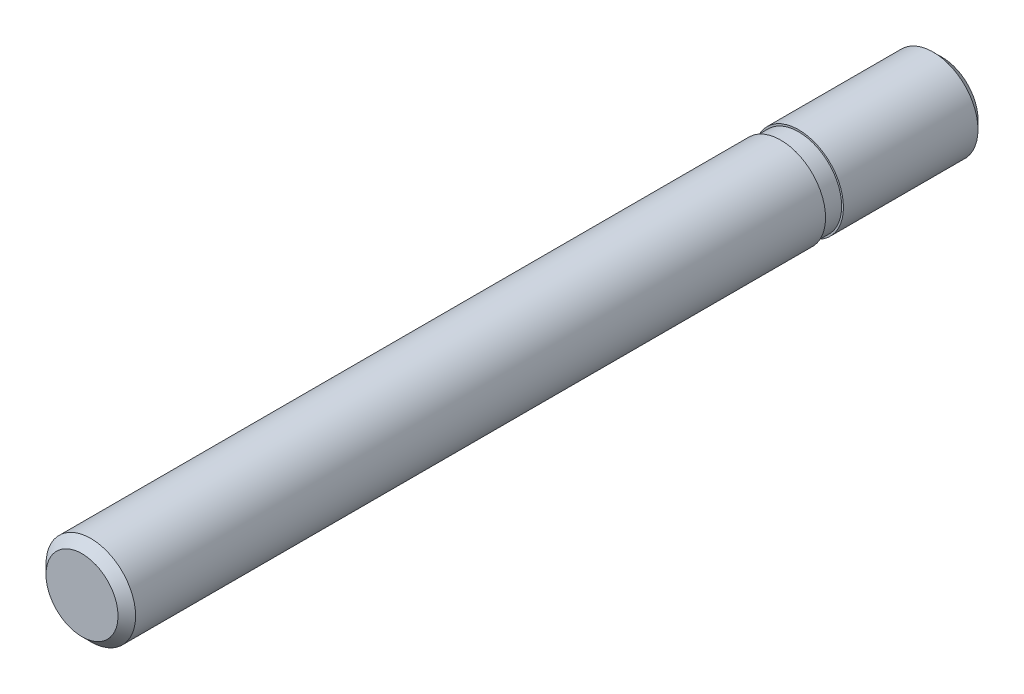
ISO-10303-21;
HEADER;
FILE_DESCRIPTION(('STEP AP214'),'2;1');
FILE_NAME('part.step','',(''),(''),'','','');
FILE_SCHEMA(('AUTOMOTIVE_DESIGN { 1 0 10303 214 1 1 1 1 }'));
ENDSEC;
DATA;
#1=APPLICATION_CONTEXT('core data for automotive mechanical design processes');
#2=APPLICATION_PROTOCOL_DEFINITION('international standard','automotive_design',2000,#1);
#3=PRODUCT_CONTEXT('',#1,'mechanical');
#4=PRODUCT('Part','Part','',(#3));
#5=PRODUCT_RELATED_PRODUCT_CATEGORY('part','',(#4));
#6=PRODUCT_DEFINITION_FORMATION('','',#4);
#7=PRODUCT_DEFINITION_CONTEXT('part definition',#1,'design');
#8=PRODUCT_DEFINITION('design','',#6,#7);
#9=PRODUCT_DEFINITION_SHAPE('','',#8);
#10=(LENGTH_UNIT() NAMED_UNIT(*) SI_UNIT(.MILLI.,.METRE.));
#11=(NAMED_UNIT(*) PLANE_ANGLE_UNIT() SI_UNIT($,.RADIAN.));
#12=(NAMED_UNIT(*) SI_UNIT($,.STERADIAN.) SOLID_ANGLE_UNIT());
#13=UNCERTAINTY_MEASURE_WITH_UNIT(LENGTH_MEASURE(1.E-05),#10,'distance_accuracy_value','');
#14=(GEOMETRIC_REPRESENTATION_CONTEXT(3) GLOBAL_UNCERTAINTY_ASSIGNED_CONTEXT((#13)) GLOBAL_UNIT_ASSIGNED_CONTEXT((#10,
#11,#12)) REPRESENTATION_CONTEXT('',''));
#15=CARTESIAN_POINT('',(0.,0.,0.));
#16=DIRECTION('',(0.,0.,1.));
#17=DIRECTION('',(1.,0.,0.));
#18=AXIS2_PLACEMENT_3D('',#15,#16,#17);
#19=CARTESIAN_POINT('',(0.,0.,0.));
#20=DIRECTION('',(0.,0.,1.));
#21=DIRECTION('',(1.,0.,0.));
#22=AXIS2_PLACEMENT_3D('',#19,#20,#21);
#23=PLANE('',#22);
#24=CARTESIAN_POINT('',(0.,0.,0.));
#25=DIRECTION('',(0.,0.,1.));
#26=DIRECTION('',(1.,0.,0.));
#27=AXIS2_PLACEMENT_3D('',#24,#25,#26);
#28=CIRCLE('',#27,2.5);
#29=CARTESIAN_POINT('',(2.5,0.,0.));
#30=VERTEX_POINT('',#29);
#31=EDGE_CURVE('E28',#30,#30,#28,.T.);
#32=ORIENTED_EDGE('',*,*,#31,.T.);
#33=EDGE_LOOP('',(#32));
#34=FACE_BOUND('',#33,.T.);
#35=CARTESIAN_POINT('',(0.,0.,0.));
#36=DIRECTION('',(0.,0.,1.));
#37=DIRECTION('',(1.,0.,0.));
#38=AXIS2_PLACEMENT_3D('',#35,#36,#37);
#39=CIRCLE('',#38,2.4);
#40=CARTESIAN_POINT('',(2.4,0.,0.));
#41=VERTEX_POINT('',#40);
#42=EDGE_CURVE('E44',#41,#41,#39,.T.);
#43=ORIENTED_EDGE('',*,*,#42,.F.);
#44=EDGE_LOOP('',(#43));
#45=FACE_BOUND('',#44,.T.);
#46=ADVANCED_FACE('F12',(#34,#45),#23,.T.);
#47=CARTESIAN_POINT('',(0.,1.00475,-8.));
#48=DIRECTION('',(0.,0.,-1.));
#49=DIRECTION('',(-1.,0.,0.));
#50=AXIS2_PLACEMENT_3D('',#47,#48,#49);
#51=PLANE('',#50);
#52=CARTESIAN_POINT('',(0.,0.,-8.00000000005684));
#53=DIRECTION('',(0.,0.,1.));
#54=DIRECTION('',(1.,0.,0.));
#55=AXIS2_PLACEMENT_3D('',#52,#53,#54);
#56=CIRCLE('',#55,2.00949999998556);
#57=CARTESIAN_POINT('',(2.00949999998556,0.,-8.00000000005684));
#58=VERTEX_POINT('',#57);
#59=EDGE_CURVE('E19',#58,#58,#56,.T.);
#60=ORIENTED_EDGE('',*,*,#59,.F.);
#61=EDGE_LOOP('',(#60));
#62=FACE_BOUND('',#61,.T.);
#63=ADVANCED_FACE('F52',(#62),#51,.T.);
#64=CARTESIAN_POINT('',(0.,0.,-7.50950000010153));
#65=DIRECTION('',(0.,0.,1.));
#66=DIRECTION('',(1.,0.,0.));
#67=AXIS2_PLACEMENT_3D('',#64,#65,#66);
#68=CONICAL_SURFACE('',#67,2.49999999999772,0.785398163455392);
#69=CARTESIAN_POINT('',(0.,0.,-7.5095));
#70=DIRECTION('',(0.,0.,1.));
#71=DIRECTION('',(1.,0.,0.));
#72=AXIS2_PLACEMENT_3D('',#69,#70,#71);
#73=CIRCLE('',#72,2.5);
#74=CARTESIAN_POINT('',(2.5,0.,-7.5095));
#75=VERTEX_POINT('',#74);
#76=EDGE_CURVE('E23',#75,#75,#73,.T.);
#77=ORIENTED_EDGE('',*,*,#76,.F.);
#78=EDGE_LOOP('',(#77));
#79=FACE_BOUND('',#78,.T.);
#80=ORIENTED_EDGE('',*,*,#59,.T.);
#81=EDGE_LOOP('',(#80));
#82=FACE_BOUND('',#81,.T.);
#83=ADVANCED_FACE('F60',(#79,#82),#68,.T.);
#84=CARTESIAN_POINT('',(0.,0.,6.5));
#85=DIRECTION('',(0.,0.,1.));
#86=DIRECTION('',(1.,0.,0.));
#87=AXIS2_PLACEMENT_3D('',#84,#85,#86);
#88=CYLINDRICAL_SURFACE('',#87,2.5);
#89=ORIENTED_EDGE('',*,*,#31,.F.);
#90=EDGE_LOOP('',(#89));
#91=FACE_BOUND('',#90,.T.);
#92=ORIENTED_EDGE('',*,*,#76,.T.);
#93=EDGE_LOOP('',(#92));
#94=FACE_BOUND('',#93,.T.);
#95=ADVANCED_FACE('F66',(#91,#94),#88,.T.);
#96=CARTESIAN_POINT('',(0.,0.,3.16843372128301));
#97=DIRECTION('',(0.,0.,1.));
#98=DIRECTION('',(1.,0.,0.));
#99=AXIS2_PLACEMENT_3D('',#96,#97,#98);
#100=CYLINDRICAL_SURFACE('',#99,2.4);
#101=CARTESIAN_POINT('',(0.,0.,1.));
#102=DIRECTION('',(0.,0.,1.));
#103=DIRECTION('',(1.,0.,0.));
#104=AXIS2_PLACEMENT_3D('',#101,#102,#103);
#105=CIRCLE('',#104,2.4);
#106=CARTESIAN_POINT('',(2.4,0.,1.));
#107=VERTEX_POINT('',#106);
#108=EDGE_CURVE('E8',#107,#107,#105,.F.);
#109=ORIENTED_EDGE('',*,*,#108,.T.);
#110=EDGE_LOOP('',(#109));
#111=FACE_BOUND('',#110,.T.);
#112=ORIENTED_EDGE('',*,*,#42,.T.);
#113=EDGE_LOOP('',(#112));
#114=FACE_BOUND('',#113,.T.);
#115=ADVANCED_FACE('F49',(#111,#114),#100,.T.);
#116=CARTESIAN_POINT('',(0.,1.00475,40.));
#117=DIRECTION('',(0.,0.,1.));
#118=DIRECTION('',(1.,0.,0.));
#119=AXIS2_PLACEMENT_3D('',#116,#117,#118);
#120=PLANE('',#119);
#121=CARTESIAN_POINT('',(0.,0.,40.0000000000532));
#122=DIRECTION('',(0.,0.,-1.));
#123=DIRECTION('',(-1.,0.,0.));
#124=AXIS2_PLACEMENT_3D('',#121,#122,#123);
#125=CIRCLE('',#124,2.00949999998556);
#126=CARTESIAN_POINT('',(-2.00949999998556,0.,40.0000000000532));
#127=VERTEX_POINT('',#126);
#128=EDGE_CURVE('E31',#127,#127,#125,.T.);
#129=ORIENTED_EDGE('',*,*,#128,.F.);
#130=EDGE_LOOP('',(#129));
#131=FACE_BOUND('',#130,.T.);
#132=ADVANCED_FACE('F95',(#131),#120,.T.);
#133=CARTESIAN_POINT('',(0.,0.,39.5095000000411));
#134=DIRECTION('',(0.,0.,-1.));
#135=DIRECTION('',(-1.,0.,0.));
#136=AXIS2_PLACEMENT_3D('',#133,#134,#135);
#137=CONICAL_SURFACE('',#136,2.50000000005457,0.785398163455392);
#138=ORIENTED_EDGE('',*,*,#128,.T.);
#139=EDGE_LOOP('',(#138));
#140=FACE_BOUND('',#139,.T.);
#141=CARTESIAN_POINT('',(0.,0.,39.5095));
#142=DIRECTION('',(0.,0.,1.));
#143=DIRECTION('',(1.,0.,0.));
#144=AXIS2_PLACEMENT_3D('',#141,#142,#143);
#145=CIRCLE('',#144,2.5);
#146=CARTESIAN_POINT('',(2.5,0.,39.5095));
#147=VERTEX_POINT('',#146);
#148=EDGE_CURVE('E37',#147,#147,#145,.F.);
#149=ORIENTED_EDGE('',*,*,#148,.F.);
#150=EDGE_LOOP('',(#149));
#151=FACE_BOUND('',#150,.T.);
#152=ADVANCED_FACE('F103',(#140,#151),#137,.T.);
#153=CARTESIAN_POINT('',(0.,0.,6.5));
#154=DIRECTION('',(0.,0.,1.));
#155=DIRECTION('',(1.,0.,0.));
#156=AXIS2_PLACEMENT_3D('',#153,#154,#155);
#157=CYLINDRICAL_SURFACE('',#156,2.5);
#158=CARTESIAN_POINT('',(0.,0.,1.));
#159=DIRECTION('',(0.,0.,1.));
#160=DIRECTION('',(1.,0.,0.));
#161=AXIS2_PLACEMENT_3D('',#158,#159,#160);
#162=CIRCLE('',#161,2.5);
#163=CARTESIAN_POINT('',(2.5,0.,1.));
#164=VERTEX_POINT('',#163);
#165=EDGE_CURVE('E35',#164,#164,#162,.T.);
#166=ORIENTED_EDGE('',*,*,#165,.T.);
#167=EDGE_LOOP('',(#166));
#168=FACE_BOUND('',#167,.T.);
#169=ORIENTED_EDGE('',*,*,#148,.T.);
#170=EDGE_LOOP('',(#169));
#171=FACE_BOUND('',#170,.T.);
#172=ADVANCED_FACE('F14',(#168,#171),#157,.T.);
#173=CARTESIAN_POINT('',(0.,0.,1.));
#174=DIRECTION('',(0.,0.,1.));
#175=DIRECTION('',(1.,0.,0.));
#176=AXIS2_PLACEMENT_3D('',#173,#174,#175);
#177=PLANE('',#176);
#178=ORIENTED_EDGE('',*,*,#165,.F.);
#179=EDGE_LOOP('',(#178));
#180=FACE_BOUND('',#179,.T.);
#181=ORIENTED_EDGE('',*,*,#108,.F.);
#182=EDGE_LOOP('',(#181));
#183=FACE_BOUND('',#182,.T.);
#184=ADVANCED_FACE('F64',(#180,#183),#177,.F.);
#185=CLOSED_SHELL('',(#46,#63,#83,#95,#115,#132,#152,#172,#184));
#186=MANIFOLD_SOLID_BREP('B1',#185);
#187=ADVANCED_BREP_SHAPE_REPRESENTATION('',(#18,#186),#14);
#188=SHAPE_DEFINITION_REPRESENTATION(#9,#187);
ENDSEC;
END-ISO-10303-21;
